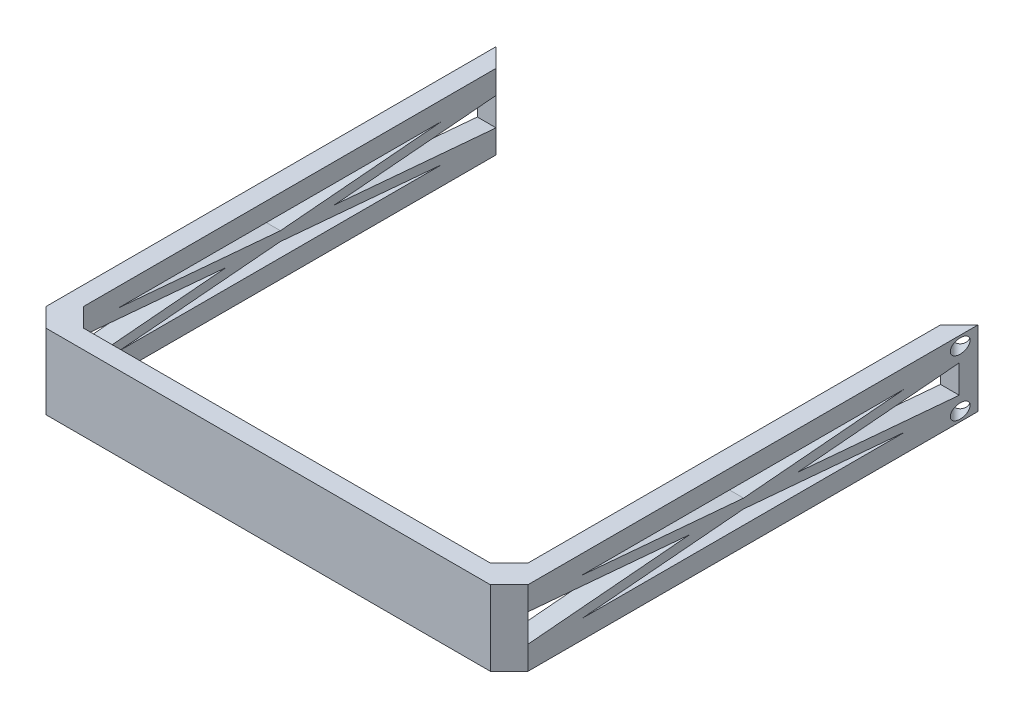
ISO-10303-21;
HEADER;
FILE_DESCRIPTION(('STEP AP214'),'2;1');
FILE_NAME('part.step','',(''),(''),'','','');
FILE_SCHEMA(('AUTOMOTIVE_DESIGN { 1 0 10303 214 1 1 1 1 }'));
ENDSEC;
DATA;
#1=APPLICATION_CONTEXT('core data for automotive mechanical design processes');
#2=APPLICATION_PROTOCOL_DEFINITION('international standard','automotive_design',2000,#1);
#3=PRODUCT_CONTEXT('',#1,'mechanical');
#4=PRODUCT('Part','Part','',(#3));
#5=PRODUCT_RELATED_PRODUCT_CATEGORY('part','',(#4));
#6=PRODUCT_DEFINITION_FORMATION('','',#4);
#7=PRODUCT_DEFINITION_CONTEXT('part definition',#1,'design');
#8=PRODUCT_DEFINITION('design','',#6,#7);
#9=PRODUCT_DEFINITION_SHAPE('','',#8);
#10=(LENGTH_UNIT() NAMED_UNIT(*) SI_UNIT(.MILLI.,.METRE.));
#11=(NAMED_UNIT(*) PLANE_ANGLE_UNIT() SI_UNIT($,.RADIAN.));
#12=(NAMED_UNIT(*) SI_UNIT($,.STERADIAN.) SOLID_ANGLE_UNIT());
#13=UNCERTAINTY_MEASURE_WITH_UNIT(LENGTH_MEASURE(1.E-05),#10,'distance_accuracy_value','');
#14=(GEOMETRIC_REPRESENTATION_CONTEXT(3) GLOBAL_UNCERTAINTY_ASSIGNED_CONTEXT((#13)) GLOBAL_UNIT_ASSIGNED_CONTEXT((#10,
#11,#12)) REPRESENTATION_CONTEXT('',''));
#15=CARTESIAN_POINT('',(0.,0.,0.));
#16=DIRECTION('',(0.,0.,1.));
#17=DIRECTION('',(1.,0.,0.));
#18=AXIS2_PLACEMENT_3D('',#15,#16,#17);
#19=CARTESIAN_POINT('',(-12.0621283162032,9.0406656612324,100.));
#20=DIRECTION('',(-1.,0.,0.));
#21=DIRECTION('',(0.,0.,1.));
#22=AXIS2_PLACEMENT_3D('',#19,#20,#21);
#23=PLANE('',#22);
#24=DIRECTION('',(0.,0.,-1.));
#25=VECTOR('',#24,1.);
#26=CARTESIAN_POINT('',(-12.0621283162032,9.0406656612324,100.));
#27=LINE('',#26,#25);
#28=CARTESIAN_POINT('',(-12.0621283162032,9.0406656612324,92.));
#29=VERTEX_POINT('',#28);
#30=CARTESIAN_POINT('',(-12.0621283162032,9.0406656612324,4.));
#31=VERTEX_POINT('',#30);
#32=EDGE_CURVE('E633',#29,#31,#27,.T.);
#33=ORIENTED_EDGE('',*,*,#32,.F.);
#34=DIRECTION('',(0.,-1.,0.));
#35=VECTOR('',#34,1.);
#36=CARTESIAN_POINT('',(-12.0621283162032,4.03689206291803,92.));
#37=LINE('',#36,#35);
#38=CARTESIAN_POINT('',(-12.0621283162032,3.68906597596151,92.));
#39=VERTEX_POINT('',#38);
#40=EDGE_CURVE('E658',#29,#39,#37,.T.);
#41=ORIENTED_EDGE('',*,*,#40,.T.);
#42=DIRECTION('',(0.,-0.086629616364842,-0.996240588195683));
#43=VECTOR('',#42,1.);
#44=CARTESIAN_POINT('',(-12.0621283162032,4.4196595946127,100.401826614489));
#45=LINE('',#44,#43);
#46=CARTESIAN_POINT('',(-12.0621283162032,1.0406656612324,61.5433963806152));
#47=VERTEX_POINT('',#46);
#48=EDGE_CURVE('E593',#39,#47,#45,.T.);
#49=ORIENTED_EDGE('',*,*,#48,.T.);
#50=DIRECTION('',(0.,-0.086629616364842,0.996240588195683));
#51=VECTOR('',#50,1.);
#52=CARTESIAN_POINT('',(-12.0621283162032,-2.21825322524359,99.0209635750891));
#53=LINE('',#52,#51);
#54=CARTESIAN_POINT('',(-12.0621283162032,-1.60773465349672,92.));
#55=VERTEX_POINT('',#54);
#56=EDGE_CURVE('E586',#47,#55,#53,.T.);
#57=ORIENTED_EDGE('',*,*,#56,.T.);
#58=DIRECTION('',(0.,-1.,0.));
#59=VECTOR('',#58,1.);
#60=CARTESIAN_POINT('',(-12.0621283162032,-6.95933433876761,92.));
#61=LINE('',#60,#59);
#62=CARTESIAN_POINT('',(-12.0621283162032,-6.95933433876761,92.));
#63=VERTEX_POINT('',#62);
#64=EDGE_CURVE('E656',#55,#63,#61,.T.);
#65=ORIENTED_EDGE('',*,*,#64,.T.);
#66=DIRECTION('',(0.,0.,-1.));
#67=VECTOR('',#66,1.);
#68=CARTESIAN_POINT('',(-12.0621283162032,-6.95933433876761,100.));
#69=LINE('',#68,#67);
#70=CARTESIAN_POINT('',(-12.0621283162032,-6.95933433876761,4.));
#71=VERTEX_POINT('',#70);
#72=EDGE_CURVE('E635',#63,#71,#69,.T.);
#73=ORIENTED_EDGE('',*,*,#72,.T.);
#74=DIRECTION('',(0.,1.,0.));
#75=VECTOR('',#74,1.);
#76=CARTESIAN_POINT('',(-12.0621283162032,9.0406656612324,4.));
#77=LINE('',#76,#75);
#78=CARTESIAN_POINT('',(-12.0621283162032,-1.95556074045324,4.));
#79=VERTEX_POINT('',#78);
#80=EDGE_CURVE('E640',#71,#79,#77,.T.);
#81=ORIENTED_EDGE('',*,*,#80,.T.);
#82=DIRECTION('',(0.,-0.086629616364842,-0.996240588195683));
#83=VECTOR('',#82,1.);
#84=CARTESIAN_POINT('',(-12.0621283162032,6.41214077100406,100.228567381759));
#85=LINE('',#84,#83);
#86=CARTESIAN_POINT('',(-12.0621283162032,1.0406656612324,38.4566036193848));
#87=VERTEX_POINT('',#86);
#88=EDGE_CURVE('E604',#87,#79,#85,.T.);
#89=ORIENTED_EDGE('',*,*,#88,.F.);
#90=DIRECTION('',(0.,-0.086629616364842,0.996240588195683));
#91=VECTOR('',#90,1.);
#92=CARTESIAN_POINT('',(-12.0621283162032,-4.21073440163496,98.8477043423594));
#93=LINE('',#92,#91);
#94=CARTESIAN_POINT('',(-12.0621283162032,4.03689206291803,4.));
#95=VERTEX_POINT('',#94);
#96=EDGE_CURVE('E607',#95,#87,#93,.T.);
#97=ORIENTED_EDGE('',*,*,#96,.F.);
#98=EDGE_CURVE('E639',#95,#31,#77,.T.);
#99=ORIENTED_EDGE('',*,*,#98,.T.);
#100=EDGE_LOOP('',(#33,#41,#49,#57,#65,#73,#81,#89,#97,#99));
#101=FACE_BOUND('',#100,.T.);
#102=DIRECTION('',(0.,-0.086629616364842,-0.996240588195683));
#103=VECTOR('',#102,1.);
#104=CARTESIAN_POINT('',(-12.0621283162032,6.41214077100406,100.228567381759));
#105=LINE('',#104,#103);
#106=CARTESIAN_POINT('',(-12.0621283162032,5.04066566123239,84.4566036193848));
#107=VERTEX_POINT('',#106);
#108=CARTESIAN_POINT('',(-12.0621283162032,2.04443925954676,50.));
#109=VERTEX_POINT('',#108);
#110=EDGE_CURVE('E598',#107,#109,#105,.T.);
#111=ORIENTED_EDGE('',*,*,#110,.F.);
#112=DIRECTION('',(0.,0.,-1.));
#113=VECTOR('',#112,1.);
#114=CARTESIAN_POINT('',(-12.0621283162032,5.0406656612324,100.));
#115=LINE('',#114,#113);
#116=CARTESIAN_POINT('',(-12.0621283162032,5.0406656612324,15.5433963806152));
#117=VERTEX_POINT('',#116);
#118=EDGE_CURVE('E601',#107,#117,#115,.T.);
#119=ORIENTED_EDGE('',*,*,#118,.T.);
#120=DIRECTION('',(0.,-0.086629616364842,0.996240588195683));
#121=VECTOR('',#120,1.);
#122=CARTESIAN_POINT('',(-12.0621283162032,-2.21825322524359,99.0209635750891));
#123=LINE('',#122,#121);
#124=EDGE_CURVE('E595',#117,#109,#123,.T.);
#125=ORIENTED_EDGE('',*,*,#124,.T.);
#126=EDGE_LOOP('',(#111,#119,#125));
#127=FACE_BOUND('',#126,.T.);
#128=DIRECTION('',(0.,-0.086629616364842,0.996240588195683));
#129=VECTOR('',#128,1.);
#130=CARTESIAN_POINT('',(-12.0621283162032,-4.21073440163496,98.8477043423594));
#131=LINE('',#130,#129);
#132=CARTESIAN_POINT('',(-12.0621283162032,0.0368920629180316,50.));
#133=VERTEX_POINT('',#132);
#134=CARTESIAN_POINT('',(-12.0621283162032,-2.9593343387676,84.4566036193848));
#135=VERTEX_POINT('',#134);
#136=EDGE_CURVE('E615',#133,#135,#131,.T.);
#137=ORIENTED_EDGE('',*,*,#136,.F.);
#138=DIRECTION('',(0.,-0.086629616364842,-0.996240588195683));
#139=VECTOR('',#138,1.);
#140=CARTESIAN_POINT('',(-12.0621283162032,4.4196595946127,100.401826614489));
#141=LINE('',#140,#139);
#142=CARTESIAN_POINT('',(-12.0621283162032,-2.9593343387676,15.5433963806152));
#143=VERTEX_POINT('',#142);
#144=EDGE_CURVE('E609',#133,#143,#141,.T.);
#145=ORIENTED_EDGE('',*,*,#144,.T.);
#146=DIRECTION('',(0.,0.,1.));
#147=VECTOR('',#146,1.);
#148=CARTESIAN_POINT('',(-12.0621283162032,-2.9593343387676,100.));
#149=LINE('',#148,#147);
#150=EDGE_CURVE('E612',#143,#135,#149,.T.);
#151=ORIENTED_EDGE('',*,*,#150,.T.);
#152=EDGE_LOOP('',(#137,#145,#151));
#153=FACE_BOUND('',#152,.T.);
#154=ADVANCED_FACE('F107',(#101,#127,#153),#23,.F.);
#155=CARTESIAN_POINT('',(-16.0621283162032,9.0406656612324,100.));
#156=DIRECTION('',(1.,0.,0.));
#157=DIRECTION('',(0.,1.,0.));
#158=AXIS2_PLACEMENT_3D('',#155,#156,#157);
#159=PLANE('',#158);
#160=CARTESIAN_POINT('',(-16.0621283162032,7.04066566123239,3.79592435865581));
#161=DIRECTION('',(1.,0.,0.));
#162=DIRECTION('',(0.,0.,-1.));
#163=AXIS2_PLACEMENT_3D('',#160,#161,#162);
#164=ELLIPSE('',#163,2.12132034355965,1.5);
#165=CARTESIAN_POINT('',(-16.0621283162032,7.04066566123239,1.67460401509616));
#166=VERTEX_POINT('',#165);
#167=EDGE_CURVE('E524',#166,#166,#164,.T.);
#168=ORIENTED_EDGE('',*,*,#167,.T.);
#169=EDGE_LOOP('',(#168));
#170=FACE_BOUND('',#169,.T.);
#171=CARTESIAN_POINT('',(-16.0621283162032,-4.95933433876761,3.79592435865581));
#172=DIRECTION('',(1.,0.,0.));
#173=DIRECTION('',(0.,0.,-1.));
#174=AXIS2_PLACEMENT_3D('',#171,#172,#173);
#175=ELLIPSE('',#174,2.12132034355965,1.5);
#176=CARTESIAN_POINT('',(-16.0621283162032,-4.95933433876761,1.67460401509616));
#177=VERTEX_POINT('',#176);
#178=EDGE_CURVE('E519',#177,#177,#175,.T.);
#179=ORIENTED_EDGE('',*,*,#178,.T.);
#180=EDGE_LOOP('',(#179));
#181=FACE_BOUND('',#180,.T.);
#182=DIRECTION('',(0.,-0.086629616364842,0.996240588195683));
#183=VECTOR('',#182,1.);
#184=CARTESIAN_POINT('',(-16.0621283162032,4.35181219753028,0.378418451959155));
#185=LINE('',#184,#183);
#186=CARTESIAN_POINT('',(-16.0621283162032,4.03689206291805,4.));
#187=VERTEX_POINT('',#186);
#188=CARTESIAN_POINT('',(-16.0621283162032,1.0406656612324,38.4566036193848));
#189=VERTEX_POINT('',#188);
#190=EDGE_CURVE('E527',#187,#189,#185,.T.);
#191=ORIENTED_EDGE('',*,*,#190,.T.);
#192=DIRECTION('',(0.,-0.086629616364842,-0.996240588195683));
#193=VECTOR('',#192,1.);
#194=CARTESIAN_POINT('',(-16.0621283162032,-2.28610062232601,0.198791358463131));
#195=LINE('',#194,#193);
#196=CARTESIAN_POINT('',(-16.0621283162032,-1.95556074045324,4.));
#197=VERTEX_POINT('',#196);
#198=EDGE_CURVE('E533',#189,#197,#195,.T.);
#199=ORIENTED_EDGE('',*,*,#198,.T.);
#200=DIRECTION('',(0.,-1.,0.));
#201=VECTOR('',#200,1.);
#202=CARTESIAN_POINT('',(-16.0621283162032,0.,4.));
#203=LINE('',#202,#201);
#204=EDGE_CURVE('E530',#187,#197,#203,.T.);
#205=ORIENTED_EDGE('',*,*,#204,.F.);
#206=EDGE_LOOP('',(#191,#199,#205));
#207=FACE_BOUND('',#206,.T.);
#208=DIRECTION('',(0.,-0.086629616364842,0.996240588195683));
#209=VECTOR('',#208,1.);
#210=CARTESIAN_POINT('',(-16.0621283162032,6.34429337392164,0.551677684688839));
#211=LINE('',#210,#209);
#212=CARTESIAN_POINT('',(-16.0621283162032,5.04066566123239,15.5433963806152));
#213=VERTEX_POINT('',#212);
#214=CARTESIAN_POINT('',(-16.0621283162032,2.04443925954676,50.));
#215=VERTEX_POINT('',#214);
#216=EDGE_CURVE('E577',#213,#215,#211,.T.);
#217=ORIENTED_EDGE('',*,*,#216,.F.);
#218=DIRECTION('',(0.,0.,-1.));
#219=VECTOR('',#218,1.);
#220=CARTESIAN_POINT('',(-16.0621283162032,5.04066566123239,0.));
#221=LINE('',#220,#219);
#222=CARTESIAN_POINT('',(-16.0621283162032,5.04066566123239,84.4566036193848));
#223=VERTEX_POINT('',#222);
#224=EDGE_CURVE('E570',#223,#213,#221,.T.);
#225=ORIENTED_EDGE('',*,*,#224,.F.);
#226=DIRECTION('',(0.,-0.086629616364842,-0.996240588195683));
#227=VECTOR('',#226,1.);
#228=CARTESIAN_POINT('',(-16.0621283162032,-2.28610062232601,0.198791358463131));
#229=LINE('',#228,#227);
#230=EDGE_CURVE('E580',#223,#215,#229,.T.);
#231=ORIENTED_EDGE('',*,*,#230,.T.);
#232=EDGE_LOOP('',(#217,#225,#231));
#233=FACE_BOUND('',#232,.T.);
#234=DIRECTION('',(0.,0.,-1.));
#235=VECTOR('',#234,1.);
#236=CARTESIAN_POINT('',(-16.0621283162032,-6.95933433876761,100.));
#237=LINE('',#236,#235);
#238=CARTESIAN_POINT('',(-16.0621283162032,-6.95933433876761,96.));
#239=VERTEX_POINT('',#238);
#240=CARTESIAN_POINT('',(-16.0621283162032,-6.95933433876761,0.));
#241=VERTEX_POINT('',#240);
#242=EDGE_CURVE('E637',#239,#241,#237,.T.);
#243=ORIENTED_EDGE('',*,*,#242,.F.);
#244=DIRECTION('',(0.,1.,0.));
#245=VECTOR('',#244,1.);
#246=CARTESIAN_POINT('',(-16.0621283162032,9.04066566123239,96.));
#247=LINE('',#246,#245);
#248=CARTESIAN_POINT('',(-16.0621283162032,-1.95556074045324,96.));
#249=VERTEX_POINT('',#248);
#250=EDGE_CURVE('E665',#239,#249,#247,.T.);
#251=ORIENTED_EDGE('',*,*,#250,.T.);
#252=DIRECTION('',(0.,-0.086629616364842,0.996240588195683));
#253=VECTOR('',#252,1.);
#254=CARTESIAN_POINT('',(-16.0621283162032,6.34429337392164,0.551677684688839));
#255=LINE('',#254,#253);
#256=CARTESIAN_POINT('',(-16.0621283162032,1.04066566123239,61.5433963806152));
#257=VERTEX_POINT('',#256);
#258=EDGE_CURVE('E561',#257,#249,#255,.T.);
#259=ORIENTED_EDGE('',*,*,#258,.F.);
#260=DIRECTION('',(0.,-0.086629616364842,-0.996240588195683));
#261=VECTOR('',#260,1.);
#262=CARTESIAN_POINT('',(-16.0621283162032,-4.27858179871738,0.372050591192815));
#263=LINE('',#262,#261);
#264=CARTESIAN_POINT('',(-16.0621283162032,4.03689206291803,96.));
#265=VERTEX_POINT('',#264);
#266=EDGE_CURVE('E555',#265,#257,#263,.T.);
#267=ORIENTED_EDGE('',*,*,#266,.F.);
#268=DIRECTION('',(0.,1.,0.));
#269=VECTOR('',#268,1.);
#270=CARTESIAN_POINT('',(-16.0621283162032,9.04066566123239,96.));
#271=LINE('',#270,#269);
#272=CARTESIAN_POINT('',(-16.0621283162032,9.0406656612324,96.));
#273=VERTEX_POINT('',#272);
#274=EDGE_CURVE('E123',#265,#273,#271,.T.);
#275=ORIENTED_EDGE('',*,*,#274,.T.);
#276=DIRECTION('',(0.,0.,-1.));
#277=VECTOR('',#276,1.);
#278=CARTESIAN_POINT('',(-16.0621283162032,9.0406656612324,100.));
#279=LINE('',#278,#277);
#280=CARTESIAN_POINT('',(-16.0621283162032,9.0406656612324,0.));
#281=VERTEX_POINT('',#280);
#282=EDGE_CURVE('E629',#273,#281,#279,.T.);
#283=ORIENTED_EDGE('',*,*,#282,.T.);
#284=DIRECTION('',(0.,-1.,0.));
#285=VECTOR('',#284,1.);
#286=CARTESIAN_POINT('',(-16.0621283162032,9.0406656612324,0.));
#287=LINE('',#286,#285);
#288=EDGE_CURVE('E623',#281,#241,#287,.T.);
#289=ORIENTED_EDGE('',*,*,#288,.T.);
#290=EDGE_LOOP('',(#243,#251,#259,#267,#275,#283,#289));
#291=FACE_BOUND('',#290,.T.);
#292=DIRECTION('',(0.,-0.086629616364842,0.996240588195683));
#293=VECTOR('',#292,1.);
#294=CARTESIAN_POINT('',(-16.0621283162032,4.35181219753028,0.378418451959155));
#295=LINE('',#294,#293);
#296=CARTESIAN_POINT('',(-16.0621283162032,0.0368920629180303,50.));
#297=VERTEX_POINT('',#296);
#298=CARTESIAN_POINT('',(-16.0621283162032,-2.95933433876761,84.4566036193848));
#299=VERTEX_POINT('',#298);
#300=EDGE_CURVE('E539',#297,#299,#295,.T.);
#301=ORIENTED_EDGE('',*,*,#300,.T.);
#302=DIRECTION('',(0.,0.,1.));
#303=VECTOR('',#302,1.);
#304=CARTESIAN_POINT('',(-16.0621283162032,-2.95933433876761,0.));
#305=LINE('',#304,#303);
#306=CARTESIAN_POINT('',(-16.0621283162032,-2.95933433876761,15.5433963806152));
#307=VERTEX_POINT('',#306);
#308=EDGE_CURVE('E549',#307,#299,#305,.T.);
#309=ORIENTED_EDGE('',*,*,#308,.F.);
#310=DIRECTION('',(0.,-0.086629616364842,-0.996240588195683));
#311=VECTOR('',#310,1.);
#312=CARTESIAN_POINT('',(-16.0621283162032,-4.27858179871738,0.372050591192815));
#313=LINE('',#312,#311);
#314=EDGE_CURVE('E546',#297,#307,#313,.T.);
#315=ORIENTED_EDGE('',*,*,#314,.F.);
#316=EDGE_LOOP('',(#301,#309,#315));
#317=FACE_BOUND('',#316,.T.);
#318=ADVANCED_FACE('F724',(#170,#181,#207,#233,#291,#317),#159,.F.);
#319=CARTESIAN_POINT('',(-16.0621283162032,-6.95933433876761,100.));
#320=DIRECTION('',(0.,1.,0.));
#321=DIRECTION('',(0.,0.,1.));
#322=AXIS2_PLACEMENT_3D('',#319,#320,#321);
#323=PLANE('',#322);
#324=DIRECTION('',(1.,0.,0.));
#325=VECTOR('',#324,1.);
#326=CARTESIAN_POINT('',(-16.0621283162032,-6.95933433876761,100.));
#327=LINE('',#326,#325);
#328=CARTESIAN_POINT('',(-12.0621283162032,-6.95933433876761,100.));
#329=VERTEX_POINT('',#328);
#330=CARTESIAN_POINT('',(82.7278716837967,-6.95933433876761,100.));
#331=VERTEX_POINT('',#330);
#332=EDGE_CURVE('E624',#329,#331,#327,.T.);
#333=ORIENTED_EDGE('',*,*,#332,.F.);
#334=DIRECTION('',(-0.707106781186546,0.,-0.707106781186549));
#335=VECTOR('',#334,1.);
#336=CARTESIAN_POINT('',(-12.0621283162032,-6.95933433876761,100.));
#337=LINE('',#336,#335);
#338=EDGE_CURVE('E131',#329,#239,#337,.T.);
#339=ORIENTED_EDGE('',*,*,#338,.T.);
#340=ORIENTED_EDGE('',*,*,#242,.T.);
#341=DIRECTION('',(-0.707106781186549,0.,-0.707106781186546));
#342=VECTOR('',#341,1.);
#343=CARTESIAN_POINT('',(-12.0621283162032,-6.95933433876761,4.));
#344=LINE('',#343,#342);
#345=EDGE_CURVE('E647',#241,#71,#344,.F.);
#346=ORIENTED_EDGE('',*,*,#345,.T.);
#347=ORIENTED_EDGE('',*,*,#72,.F.);
#348=DIRECTION('',(-0.707106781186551,0.,-0.707106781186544));
#349=VECTOR('',#348,1.);
#350=CARTESIAN_POINT('',(-10.0621283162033,-6.95933433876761,94.));
#351=LINE('',#350,#349);
#352=CARTESIAN_POINT('',(-8.06212831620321,-6.95933433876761,96.));
#353=VERTEX_POINT('',#352);
#354=EDGE_CURVE('E12',#63,#353,#351,.F.);
#355=ORIENTED_EDGE('',*,*,#354,.T.);
#356=DIRECTION('',(-1.,0.,0.));
#357=VECTOR('',#356,1.);
#358=CARTESIAN_POINT('',(35.3328716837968,-6.95933433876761,96.));
#359=LINE('',#358,#357);
#360=CARTESIAN_POINT('',(78.7278716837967,-6.95933433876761,96.));
#361=VERTEX_POINT('',#360);
#362=EDGE_CURVE('E620',#361,#353,#359,.T.);
#363=ORIENTED_EDGE('',*,*,#362,.F.);
#364=DIRECTION('',(0.707106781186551,0.,-0.707106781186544));
#365=VECTOR('',#364,1.);
#366=CARTESIAN_POINT('',(80.7278716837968,-6.95933433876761,94.));
#367=LINE('',#366,#365);
#368=CARTESIAN_POINT('',(82.7278716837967,-6.95933433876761,92.));
#369=VERTEX_POINT('',#368);
#370=EDGE_CURVE('E512',#369,#361,#367,.F.);
#371=ORIENTED_EDGE('',*,*,#370,.F.);
#372=DIRECTION('',(0.,0.,-1.));
#373=VECTOR('',#372,1.);
#374=CARTESIAN_POINT('',(82.7278716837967,-6.95933433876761,100.));
#375=LINE('',#374,#373);
#376=CARTESIAN_POINT('',(82.7278716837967,-6.95933433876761,4.));
#377=VERTEX_POINT('',#376);
#378=EDGE_CURVE('E467',#369,#377,#375,.T.);
#379=ORIENTED_EDGE('',*,*,#378,.T.);
#380=DIRECTION('',(0.707106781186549,0.,-0.707106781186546));
#381=VECTOR('',#380,1.);
#382=CARTESIAN_POINT('',(82.7278716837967,-6.95933433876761,4.));
#383=LINE('',#382,#381);
#384=CARTESIAN_POINT('',(86.7278716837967,-6.95933433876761,0.));
#385=VERTEX_POINT('',#384);
#386=EDGE_CURVE('E478',#385,#377,#383,.F.);
#387=ORIENTED_EDGE('',*,*,#386,.F.);
#388=DIRECTION('',(0.,0.,-1.));
#389=VECTOR('',#388,1.);
#390=CARTESIAN_POINT('',(86.7278716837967,-6.95933433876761,100.));
#391=LINE('',#390,#389);
#392=CARTESIAN_POINT('',(86.7278716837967,-6.95933433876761,96.));
#393=VERTEX_POINT('',#392);
#394=EDGE_CURVE('E470',#393,#385,#391,.T.);
#395=ORIENTED_EDGE('',*,*,#394,.F.);
#396=DIRECTION('',(0.707106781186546,0.,-0.707106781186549));
#397=VECTOR('',#396,1.);
#398=CARTESIAN_POINT('',(82.7278716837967,-6.95933433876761,100.));
#399=LINE('',#398,#397);
#400=EDGE_CURVE('E495',#331,#393,#399,.T.);
#401=ORIENTED_EDGE('',*,*,#400,.F.);
#402=EDGE_LOOP('',(#333,#339,#340,#346,#347,#355,#363,#371,#379,#387,#395,#401));
#403=FACE_BOUND('',#402,.T.);
#404=ADVANCED_FACE('F688',(#403),#323,.F.);
#405=CARTESIAN_POINT('',(-16.0621283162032,9.0406656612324,100.));
#406=DIRECTION('',(0.,-1.,0.));
#407=DIRECTION('',(0.,0.,-1.));
#408=AXIS2_PLACEMENT_3D('',#405,#406,#407);
#409=PLANE('',#408);
#410=ORIENTED_EDGE('',*,*,#282,.F.);
#411=DIRECTION('',(0.707106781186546,0.,0.707106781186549));
#412=VECTOR('',#411,1.);
#413=CARTESIAN_POINT('',(-12.0621283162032,9.0406656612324,100.));
#414=LINE('',#413,#412);
#415=CARTESIAN_POINT('',(-12.0621283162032,9.0406656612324,100.));
#416=VERTEX_POINT('',#415);
#417=EDGE_CURVE('E667',#273,#416,#414,.T.);
#418=ORIENTED_EDGE('',*,*,#417,.T.);
#419=DIRECTION('',(-1.,0.,0.));
#420=VECTOR('',#419,1.);
#421=CARTESIAN_POINT('',(-16.0621283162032,9.0406656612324,100.));
#422=LINE('',#421,#420);
#423=CARTESIAN_POINT('',(82.7278716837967,9.0406656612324,100.));
#424=VERTEX_POINT('',#423);
#425=EDGE_CURVE('E626',#424,#416,#422,.T.);
#426=ORIENTED_EDGE('',*,*,#425,.F.);
#427=DIRECTION('',(-0.707106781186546,0.,0.707106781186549));
#428=VECTOR('',#427,1.);
#429=CARTESIAN_POINT('',(82.7278716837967,9.0406656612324,100.));
#430=LINE('',#429,#428);
#431=CARTESIAN_POINT('',(86.7278716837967,9.0406656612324,96.));
#432=VERTEX_POINT('',#431);
#433=EDGE_CURVE('E503',#432,#424,#430,.T.);
#434=ORIENTED_EDGE('',*,*,#433,.F.);
#435=DIRECTION('',(0.,0.,-1.));
#436=VECTOR('',#435,1.);
#437=CARTESIAN_POINT('',(86.7278716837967,9.0406656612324,100.));
#438=LINE('',#437,#436);
#439=CARTESIAN_POINT('',(86.7278716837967,9.0406656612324,0.));
#440=VERTEX_POINT('',#439);
#441=EDGE_CURVE('E461',#432,#440,#438,.T.);
#442=ORIENTED_EDGE('',*,*,#441,.T.);
#443=DIRECTION('',(-0.707106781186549,0.,0.707106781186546));
#444=VECTOR('',#443,1.);
#445=CARTESIAN_POINT('',(82.7278716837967,9.0406656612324,4.));
#446=LINE('',#445,#444);
#447=CARTESIAN_POINT('',(82.7278716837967,9.0406656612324,4.));
#448=VERTEX_POINT('',#447);
#449=EDGE_CURVE('E476',#448,#440,#446,.F.);
#450=ORIENTED_EDGE('',*,*,#449,.F.);
#451=DIRECTION('',(0.,0.,-1.));
#452=VECTOR('',#451,1.);
#453=CARTESIAN_POINT('',(82.7278716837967,9.0406656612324,100.));
#454=LINE('',#453,#452);
#455=CARTESIAN_POINT('',(82.7278716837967,9.0406656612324,92.));
#456=VERTEX_POINT('',#455);
#457=EDGE_CURVE('E464',#456,#448,#454,.T.);
#458=ORIENTED_EDGE('',*,*,#457,.F.);
#459=DIRECTION('',(-0.707106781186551,0.,0.707106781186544));
#460=VECTOR('',#459,1.);
#461=CARTESIAN_POINT('',(80.7278716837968,9.0406656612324,94.));
#462=LINE('',#461,#460);
#463=CARTESIAN_POINT('',(78.7278716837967,9.0406656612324,96.));
#464=VERTEX_POINT('',#463);
#465=EDGE_CURVE('E506',#464,#456,#462,.F.);
#466=ORIENTED_EDGE('',*,*,#465,.F.);
#467=DIRECTION('',(-1.,0.,0.));
#468=VECTOR('',#467,1.);
#469=CARTESIAN_POINT('',(35.3328716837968,9.0406656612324,96.));
#470=LINE('',#469,#468);
#471=CARTESIAN_POINT('',(-8.06212831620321,9.0406656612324,96.));
#472=VERTEX_POINT('',#471);
#473=EDGE_CURVE('E617',#464,#472,#470,.T.);
#474=ORIENTED_EDGE('',*,*,#473,.T.);
#475=DIRECTION('',(0.707106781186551,0.,0.707106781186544));
#476=VECTOR('',#475,1.);
#477=CARTESIAN_POINT('',(-10.0621283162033,9.0406656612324,94.));
#478=LINE('',#477,#476);
#479=EDGE_CURVE('E669',#472,#29,#478,.F.);
#480=ORIENTED_EDGE('',*,*,#479,.T.);
#481=ORIENTED_EDGE('',*,*,#32,.T.);
#482=DIRECTION('',(0.707106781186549,0.,0.707106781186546));
#483=VECTOR('',#482,1.);
#484=CARTESIAN_POINT('',(-12.0621283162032,9.0406656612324,4.));
#485=LINE('',#484,#483);
#486=EDGE_CURVE('E643',#31,#281,#485,.F.);
#487=ORIENTED_EDGE('',*,*,#486,.T.);
#488=EDGE_LOOP('',(#410,#418,#426,#434,#442,#450,#458,#466,#474,#480,#481,#487));
#489=FACE_BOUND('',#488,.T.);
#490=ADVANCED_FACE('F734',(#489),#409,.F.);
#491=CARTESIAN_POINT('',(0.,0.,100.));
#492=DIRECTION('',(0.,0.,1.));
#493=DIRECTION('',(1.,0.,0.));
#494=AXIS2_PLACEMENT_3D('',#491,#492,#493);
#495=PLANE('',#494);
#496=ORIENTED_EDGE('',*,*,#425,.T.);
#497=DIRECTION('',(0.,-1.,0.));
#498=VECTOR('',#497,1.);
#499=CARTESIAN_POINT('',(-12.0621283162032,-6.9593343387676,100.));
#500=LINE('',#499,#498);
#501=EDGE_CURVE('E660',#416,#329,#500,.T.);
#502=ORIENTED_EDGE('',*,*,#501,.T.);
#503=ORIENTED_EDGE('',*,*,#332,.T.);
#504=DIRECTION('',(0.,-1.,0.));
#505=VECTOR('',#504,1.);
#506=CARTESIAN_POINT('',(82.7278716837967,-6.9593343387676,100.));
#507=LINE('',#506,#505);
#508=EDGE_CURVE('E492',#424,#331,#507,.T.);
#509=ORIENTED_EDGE('',*,*,#508,.F.);
#510=EDGE_LOOP('',(#496,#502,#503,#509));
#511=FACE_BOUND('',#510,.T.);
#512=ADVANCED_FACE('F717',(#511),#495,.T.);
#513=CARTESIAN_POINT('',(35.3328716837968,9.0406656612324,96.));
#514=DIRECTION('',(0.,0.,1.));
#515=DIRECTION('',(1.,0.,0.));
#516=AXIS2_PLACEMENT_3D('',#513,#514,#515);
#517=PLANE('',#516);
#518=DIRECTION('',(-1.,0.,0.));
#519=VECTOR('',#518,1.);
#520=CARTESIAN_POINT('',(53.9378716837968,4.03689206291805,96.));
#521=LINE('',#520,#519);
#522=CARTESIAN_POINT('',(-8.06212831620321,4.03689206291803,96.));
#523=VERTEX_POINT('',#522);
#524=EDGE_CURVE('E568',#523,#265,#521,.T.);
#525=ORIENTED_EDGE('',*,*,#524,.F.);
#526=DIRECTION('',(0.,1.,0.));
#527=VECTOR('',#526,1.);
#528=CARTESIAN_POINT('',(-8.06212831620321,9.0406656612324,96.));
#529=LINE('',#528,#527);
#530=EDGE_CURVE('E653',#523,#472,#529,.T.);
#531=ORIENTED_EDGE('',*,*,#530,.T.);
#532=ORIENTED_EDGE('',*,*,#473,.F.);
#533=DIRECTION('',(0.,1.,0.));
#534=VECTOR('',#533,1.);
#535=CARTESIAN_POINT('',(78.7278716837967,9.0406656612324,96.));
#536=LINE('',#535,#534);
#537=CARTESIAN_POINT('',(78.7278716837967,4.03689206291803,96.));
#538=VERTEX_POINT('',#537);
#539=EDGE_CURVE('E483',#538,#464,#536,.T.);
#540=ORIENTED_EDGE('',*,*,#539,.F.);
#541=DIRECTION('',(1.,0.,0.));
#542=VECTOR('',#541,1.);
#543=CARTESIAN_POINT('',(16.7278716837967,4.03689206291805,96.));
#544=LINE('',#543,#542);
#545=CARTESIAN_POINT('',(86.7278716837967,4.03689206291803,96.));
#546=VERTEX_POINT('',#545);
#547=EDGE_CURVE('E407',#538,#546,#544,.T.);
#548=ORIENTED_EDGE('',*,*,#547,.T.);
#549=DIRECTION('',(0.,1.,0.));
#550=VECTOR('',#549,1.);
#551=CARTESIAN_POINT('',(86.7278716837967,0.,96.));
#552=LINE('',#551,#550);
#553=CARTESIAN_POINT('',(86.7278716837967,-1.95556074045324,96.));
#554=VERTEX_POINT('',#553);
#555=EDGE_CURVE('E404',#554,#546,#552,.T.);
#556=ORIENTED_EDGE('',*,*,#555,.F.);
#557=DIRECTION('',(1.,0.,0.));
#558=VECTOR('',#557,1.);
#559=CARTESIAN_POINT('',(16.7278716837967,-1.95556074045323,96.));
#560=LINE('',#559,#558);
#561=CARTESIAN_POINT('',(78.7278716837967,-1.95556074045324,96.));
#562=VERTEX_POINT('',#561);
#563=EDGE_CURVE('E411',#562,#554,#560,.T.);
#564=ORIENTED_EDGE('',*,*,#563,.F.);
#565=DIRECTION('',(0.,1.,0.));
#566=VECTOR('',#565,1.);
#567=CARTESIAN_POINT('',(78.7278716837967,-1.95556074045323,96.));
#568=LINE('',#567,#566);
#569=EDGE_CURVE('E480',#361,#562,#568,.T.);
#570=ORIENTED_EDGE('',*,*,#569,.F.);
#571=ORIENTED_EDGE('',*,*,#362,.T.);
#572=DIRECTION('',(0.,1.,0.));
#573=VECTOR('',#572,1.);
#574=CARTESIAN_POINT('',(-8.06212831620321,-1.95556074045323,96.));
#575=LINE('',#574,#573);
#576=CARTESIAN_POINT('',(-8.06212831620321,-1.95556074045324,96.));
#577=VERTEX_POINT('',#576);
#578=EDGE_CURVE('E650',#353,#577,#575,.T.);
#579=ORIENTED_EDGE('',*,*,#578,.T.);
#580=DIRECTION('',(-1.,0.,0.));
#581=VECTOR('',#580,1.);
#582=CARTESIAN_POINT('',(53.9378716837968,-1.95556074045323,96.));
#583=LINE('',#582,#581);
#584=EDGE_CURVE('E571',#577,#249,#583,.T.);
#585=ORIENTED_EDGE('',*,*,#584,.T.);
#586=DIRECTION('',(0.,1.,0.));
#587=VECTOR('',#586,1.);
#588=CARTESIAN_POINT('',(-16.0621283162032,0.,96.));
#589=LINE('',#588,#587);
#590=EDGE_CURVE('E564',#249,#265,#589,.T.);
#591=ORIENTED_EDGE('',*,*,#590,.T.);
#592=EDGE_LOOP('',(#525,#531,#532,#540,#548,#556,#564,#570,#571,#579,#585,#591));
#593=FACE_BOUND('',#592,.T.);
#594=ADVANCED_FACE('F691',(#593),#517,.F.);
#595=CARTESIAN_POINT('',(-12.0621283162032,9.0406656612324,4.));
#596=DIRECTION('',(-0.707106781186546,0.,0.707106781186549));
#597=DIRECTION('',(0.,1.,0.));
#598=AXIS2_PLACEMENT_3D('',#595,#596,#597);
#599=PLANE('',#598);
#600=CARTESIAN_POINT('',(-14.1641661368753,7.04066566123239,1.8979621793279));
#601=DIRECTION('',(0.707106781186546,0.,-0.707106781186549));
#602=DIRECTION('',(-0.707106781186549,0.,-0.707106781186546));
#603=AXIS2_PLACEMENT_3D('',#600,#601,#602);
#604=CIRCLE('',#603,1.5);
#605=CARTESIAN_POINT('',(-15.2248263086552,7.04066566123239,0.837302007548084));
#606=VERTEX_POINT('',#605);
#607=EDGE_CURVE('E516',#606,#606,#604,.T.);
#608=ORIENTED_EDGE('',*,*,#607,.F.);
#609=EDGE_LOOP('',(#608));
#610=FACE_BOUND('',#609,.T.);
#611=CARTESIAN_POINT('',(-14.1641661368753,-4.95933433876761,1.8979621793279));
#612=DIRECTION('',(0.707106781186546,0.,-0.707106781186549));
#613=DIRECTION('',(-0.707106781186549,0.,-0.707106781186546));
#614=AXIS2_PLACEMENT_3D('',#611,#612,#613);
#615=CIRCLE('',#614,1.5);
#616=CARTESIAN_POINT('',(-15.2248263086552,-4.95933433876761,0.837302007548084));
#617=VERTEX_POINT('',#616);
#618=EDGE_CURVE('E515',#617,#617,#615,.T.);
#619=ORIENTED_EDGE('',*,*,#618,.F.);
#620=EDGE_LOOP('',(#619));
#621=FACE_BOUND('',#620,.T.);
#622=ORIENTED_EDGE('',*,*,#345,.F.);
#623=ORIENTED_EDGE('',*,*,#288,.F.);
#624=ORIENTED_EDGE('',*,*,#486,.F.);
#625=ORIENTED_EDGE('',*,*,#98,.F.);
#626=EDGE_CURVE('E644',#79,#95,#77,.T.);
#627=ORIENTED_EDGE('',*,*,#626,.F.);
#628=ORIENTED_EDGE('',*,*,#80,.F.);
#629=EDGE_LOOP('',(#622,#623,#624,#625,#627,#628));
#630=FACE_BOUND('',#629,.T.);
#631=ADVANCED_FACE('F753',(#610,#621,#630),#599,.F.);
#632=CARTESIAN_POINT('',(53.9378716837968,4.35181219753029,0.378418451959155));
#633=DIRECTION('',(0.,-0.996240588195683,-0.086629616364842));
#634=DIRECTION('',(0.,0.086629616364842,-0.996240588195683));
#635=AXIS2_PLACEMENT_3D('',#632,#633,#634);
#636=PLANE('',#635);
#637=ORIENTED_EDGE('',*,*,#96,.T.);
#638=DIRECTION('',(-1.,0.,0.));
#639=VECTOR('',#638,1.);
#640=CARTESIAN_POINT('',(53.9378716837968,1.04066566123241,38.4566036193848));
#641=LINE('',#640,#639);
#642=EDGE_CURVE('E537',#87,#189,#641,.T.);
#643=ORIENTED_EDGE('',*,*,#642,.T.);
#644=ORIENTED_EDGE('',*,*,#190,.F.);
#645=DIRECTION('',(-1.,0.,0.));
#646=VECTOR('',#645,1.);
#647=CARTESIAN_POINT('',(53.9378716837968,4.03689206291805,4.));
#648=LINE('',#647,#646);
#649=EDGE_CURVE('E536',#95,#187,#648,.T.);
#650=ORIENTED_EDGE('',*,*,#649,.F.);
#651=EDGE_LOOP('',(#637,#643,#644,#650));
#652=FACE_BOUND('',#651,.T.);
#653=ADVANCED_FACE('F764',(#652),#636,.T.);
#654=CARTESIAN_POINT('',(53.9378716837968,-2.286100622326,0.198791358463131));
#655=DIRECTION('',(0.,0.996240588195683,-0.086629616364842));
#656=DIRECTION('',(0.,0.086629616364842,0.996240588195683));
#657=AXIS2_PLACEMENT_3D('',#654,#655,#656);
#658=PLANE('',#657);
#659=ORIENTED_EDGE('',*,*,#88,.T.);
#660=DIRECTION('',(-1.,0.,0.));
#661=VECTOR('',#660,1.);
#662=CARTESIAN_POINT('',(53.9378716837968,-1.95556074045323,4.));
#663=LINE('',#662,#661);
#664=EDGE_CURVE('E540',#79,#197,#663,.T.);
#665=ORIENTED_EDGE('',*,*,#664,.T.);
#666=ORIENTED_EDGE('',*,*,#198,.F.);
#667=ORIENTED_EDGE('',*,*,#642,.F.);
#668=EDGE_LOOP('',(#659,#665,#666,#667));
#669=FACE_BOUND('',#668,.T.);
#670=ADVANCED_FACE('F761',(#669),#658,.T.);
#671=CARTESIAN_POINT('',(53.9378716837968,0.,4.));
#672=DIRECTION('',(0.,0.,-1.));
#673=DIRECTION('',(-1.,0.,0.));
#674=AXIS2_PLACEMENT_3D('',#671,#672,#673);
#675=PLANE('',#674);
#676=ORIENTED_EDGE('',*,*,#626,.T.);
#677=ORIENTED_EDGE('',*,*,#649,.T.);
#678=ORIENTED_EDGE('',*,*,#204,.T.);
#679=ORIENTED_EDGE('',*,*,#664,.F.);
#680=EDGE_LOOP('',(#676,#677,#678,#679));
#681=FACE_BOUND('',#680,.T.);
#682=ADVANCED_FACE('F768',(#681),#675,.F.);
#683=CARTESIAN_POINT('',(53.9378716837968,5.04066566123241,0.));
#684=DIRECTION('',(0.,1.,0.));
#685=DIRECTION('',(-1.,0.,0.));
#686=AXIS2_PLACEMENT_3D('',#683,#684,#685);
#687=PLANE('',#686);
#688=DIRECTION('',(-1.,0.,0.));
#689=VECTOR('',#688,1.);
#690=CARTESIAN_POINT('',(53.9378716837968,5.04066566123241,84.4566036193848));
#691=LINE('',#690,#689);
#692=EDGE_CURVE('E584',#107,#223,#691,.T.);
#693=ORIENTED_EDGE('',*,*,#692,.T.);
#694=ORIENTED_EDGE('',*,*,#224,.T.);
#695=DIRECTION('',(-1.,0.,0.));
#696=VECTOR('',#695,1.);
#697=CARTESIAN_POINT('',(53.9378716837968,5.04066566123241,15.5433963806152));
#698=LINE('',#697,#696);
#699=EDGE_CURVE('E583',#117,#213,#698,.T.);
#700=ORIENTED_EDGE('',*,*,#699,.F.);
#701=ORIENTED_EDGE('',*,*,#118,.F.);
#702=EDGE_LOOP('',(#693,#694,#700,#701));
#703=FACE_BOUND('',#702,.T.);
#704=ADVANCED_FACE('F781',(#703),#687,.F.);
#705=CARTESIAN_POINT('',(53.9378716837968,-2.286100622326,0.198791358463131));
#706=DIRECTION('',(0.,0.996240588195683,-0.086629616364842));
#707=DIRECTION('',(0.,0.086629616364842,0.996240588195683));
#708=AXIS2_PLACEMENT_3D('',#705,#706,#707);
#709=PLANE('',#708);
#710=ORIENTED_EDGE('',*,*,#110,.T.);
#711=DIRECTION('',(-1.,0.,0.));
#712=VECTOR('',#711,1.);
#713=CARTESIAN_POINT('',(53.9378716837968,2.04443925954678,50.));
#714=LINE('',#713,#712);
#715=EDGE_CURVE('E587',#109,#215,#714,.T.);
#716=ORIENTED_EDGE('',*,*,#715,.T.);
#717=ORIENTED_EDGE('',*,*,#230,.F.);
#718=ORIENTED_EDGE('',*,*,#692,.F.);
#719=EDGE_LOOP('',(#710,#716,#717,#718));
#720=FACE_BOUND('',#719,.T.);
#721=ADVANCED_FACE('F786',(#720),#709,.T.);
#722=CARTESIAN_POINT('',(53.9378716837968,6.34429337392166,0.551677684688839));
#723=DIRECTION('',(0.,-0.996240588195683,-0.086629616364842));
#724=DIRECTION('',(0.,0.086629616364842,-0.996240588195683));
#725=AXIS2_PLACEMENT_3D('',#722,#723,#724);
#726=PLANE('',#725);
#727=ORIENTED_EDGE('',*,*,#699,.T.);
#728=ORIENTED_EDGE('',*,*,#216,.T.);
#729=ORIENTED_EDGE('',*,*,#715,.F.);
#730=ORIENTED_EDGE('',*,*,#124,.F.);
#731=EDGE_LOOP('',(#727,#728,#729,#730));
#732=FACE_BOUND('',#731,.T.);
#733=ADVANCED_FACE('F778',(#732),#726,.F.);
#734=CARTESIAN_POINT('',(53.9378716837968,-4.27858179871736,0.372050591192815));
#735=DIRECTION('',(0.,0.996240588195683,-0.086629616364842));
#736=DIRECTION('',(0.,0.086629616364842,0.996240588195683));
#737=AXIS2_PLACEMENT_3D('',#734,#735,#736);
#738=PLANE('',#737);
#739=ORIENTED_EDGE('',*,*,#524,.T.);
#740=ORIENTED_EDGE('',*,*,#266,.T.);
#741=DIRECTION('',(-1.,0.,0.));
#742=VECTOR('',#741,1.);
#743=CARTESIAN_POINT('',(53.9378716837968,1.04066566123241,61.5433963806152));
#744=LINE('',#743,#742);
#745=EDGE_CURVE('E567',#47,#257,#744,.T.);
#746=ORIENTED_EDGE('',*,*,#745,.F.);
#747=ORIENTED_EDGE('',*,*,#48,.F.);
#748=DIRECTION('',(-0.705773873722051,-0.0613716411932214,-0.705773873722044));
#749=VECTOR('',#748,1.);
#750=CARTESIAN_POINT('',(-25.1729541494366,2.548994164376,78.8891741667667));
#751=LINE('',#750,#749);
#752=EDGE_CURVE('E671',#39,#523,#751,.F.);
#753=ORIENTED_EDGE('',*,*,#752,.T.);
#754=EDGE_LOOP('',(#739,#740,#746,#747,#753));
#755=FACE_BOUND('',#754,.T.);
#756=ADVANCED_FACE('F727',(#755),#738,.F.);
#757=CARTESIAN_POINT('',(53.9378716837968,6.34429337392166,0.551677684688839));
#758=DIRECTION('',(0.,-0.996240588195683,-0.086629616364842));
#759=DIRECTION('',(0.,0.086629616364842,-0.996240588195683));
#760=AXIS2_PLACEMENT_3D('',#757,#758,#759);
#761=PLANE('',#760);
#762=ORIENTED_EDGE('',*,*,#745,.T.);
#763=ORIENTED_EDGE('',*,*,#258,.T.);
#764=ORIENTED_EDGE('',*,*,#584,.F.);
#765=DIRECTION('',(0.705773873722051,-0.0613716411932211,0.705773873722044));
#766=VECTOR('',#765,1.);
#767=CARTESIAN_POINT('',(-25.0828023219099,-0.475502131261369,78.9793259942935));
#768=LINE('',#767,#766);
#769=EDGE_CURVE('E116',#577,#55,#768,.F.);
#770=ORIENTED_EDGE('',*,*,#769,.T.);
#771=ORIENTED_EDGE('',*,*,#56,.F.);
#772=EDGE_LOOP('',(#762,#763,#764,#770,#771));
#773=FACE_BOUND('',#772,.T.);
#774=ADVANCED_FACE('F676',(#773),#761,.F.);
#775=CARTESIAN_POINT('',(53.9378716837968,4.35181219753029,0.378418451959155));
#776=DIRECTION('',(0.,-0.996240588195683,-0.086629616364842));
#777=DIRECTION('',(0.,0.086629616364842,-0.996240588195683));
#778=AXIS2_PLACEMENT_3D('',#775,#776,#777);
#779=PLANE('',#778);
#780=ORIENTED_EDGE('',*,*,#136,.T.);
#781=DIRECTION('',(-1.,0.,0.));
#782=VECTOR('',#781,1.);
#783=CARTESIAN_POINT('',(53.9378716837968,-2.95933433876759,84.4566036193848));
#784=LINE('',#783,#782);
#785=EDGE_CURVE('E553',#135,#299,#784,.T.);
#786=ORIENTED_EDGE('',*,*,#785,.T.);
#787=ORIENTED_EDGE('',*,*,#300,.F.);
#788=DIRECTION('',(-1.,0.,0.));
#789=VECTOR('',#788,1.);
#790=CARTESIAN_POINT('',(53.9378716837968,0.0368920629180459,50.));
#791=LINE('',#790,#789);
#792=EDGE_CURVE('E552',#133,#297,#791,.T.);
#793=ORIENTED_EDGE('',*,*,#792,.F.);
#794=EDGE_LOOP('',(#780,#786,#787,#793));
#795=FACE_BOUND('',#794,.T.);
#796=ADVANCED_FACE('F848',(#795),#779,.T.);
#797=CARTESIAN_POINT('',(53.9378716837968,-2.95933433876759,0.));
#798=DIRECTION('',(0.,-1.,0.));
#799=DIRECTION('',(1.,0.,0.));
#800=AXIS2_PLACEMENT_3D('',#797,#798,#799);
#801=PLANE('',#800);
#802=DIRECTION('',(-1.,0.,0.));
#803=VECTOR('',#802,1.);
#804=CARTESIAN_POINT('',(53.9378716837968,-2.95933433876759,15.5433963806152));
#805=LINE('',#804,#803);
#806=EDGE_CURVE('E556',#143,#307,#805,.T.);
#807=ORIENTED_EDGE('',*,*,#806,.T.);
#808=ORIENTED_EDGE('',*,*,#308,.T.);
#809=ORIENTED_EDGE('',*,*,#785,.F.);
#810=ORIENTED_EDGE('',*,*,#150,.F.);
#811=EDGE_LOOP('',(#807,#808,#809,#810));
#812=FACE_BOUND('',#811,.T.);
#813=ADVANCED_FACE('F845',(#812),#801,.F.);
#814=CARTESIAN_POINT('',(53.9378716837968,-4.27858179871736,0.372050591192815));
#815=DIRECTION('',(0.,0.996240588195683,-0.086629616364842));
#816=DIRECTION('',(0.,0.086629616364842,0.996240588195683));
#817=AXIS2_PLACEMENT_3D('',#814,#815,#816);
#818=PLANE('',#817);
#819=ORIENTED_EDGE('',*,*,#792,.T.);
#820=ORIENTED_EDGE('',*,*,#314,.T.);
#821=ORIENTED_EDGE('',*,*,#806,.F.);
#822=ORIENTED_EDGE('',*,*,#144,.F.);
#823=EDGE_LOOP('',(#819,#820,#821,#822));
#824=FACE_BOUND('',#823,.T.);
#825=ADVANCED_FACE('F817',(#824),#818,.F.);
#826=CARTESIAN_POINT('',(-8.06212831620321,9.0406656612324,96.));
#827=DIRECTION('',(0.707106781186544,0.,-0.707106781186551));
#828=DIRECTION('',(0.,-1.,0.));
#829=AXIS2_PLACEMENT_3D('',#826,#827,#828);
#830=PLANE('',#829);
#831=ORIENTED_EDGE('',*,*,#752,.F.);
#832=ORIENTED_EDGE('',*,*,#40,.F.);
#833=ORIENTED_EDGE('',*,*,#479,.F.);
#834=ORIENTED_EDGE('',*,*,#530,.F.);
#835=EDGE_LOOP('',(#831,#832,#833,#834));
#836=FACE_BOUND('',#835,.T.);
#837=ADVANCED_FACE('F812',(#836),#830,.T.);
#838=CARTESIAN_POINT('',(-8.06212831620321,9.0406656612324,96.));
#839=DIRECTION('',(0.707106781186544,0.,-0.707106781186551));
#840=DIRECTION('',(0.,-1.,0.));
#841=AXIS2_PLACEMENT_3D('',#838,#839,#840);
#842=PLANE('',#841);
#843=ORIENTED_EDGE('',*,*,#354,.F.);
#844=ORIENTED_EDGE('',*,*,#64,.F.);
#845=ORIENTED_EDGE('',*,*,#769,.F.);
#846=ORIENTED_EDGE('',*,*,#578,.F.);
#847=EDGE_LOOP('',(#843,#844,#845,#846));
#848=FACE_BOUND('',#847,.T.);
#849=ADVANCED_FACE('F687',(#848),#842,.T.);
#850=CARTESIAN_POINT('',(-12.0621283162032,0.,100.));
#851=DIRECTION('',(-0.707106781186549,0.,0.707106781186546));
#852=DIRECTION('',(0.,1.,0.));
#853=AXIS2_PLACEMENT_3D('',#850,#851,#852);
#854=PLANE('',#853);
#855=ORIENTED_EDGE('',*,*,#590,.F.);
#856=ORIENTED_EDGE('',*,*,#250,.F.);
#857=ORIENTED_EDGE('',*,*,#338,.F.);
#858=ORIENTED_EDGE('',*,*,#501,.F.);
#859=ORIENTED_EDGE('',*,*,#417,.F.);
#860=ORIENTED_EDGE('',*,*,#274,.F.);
#861=EDGE_LOOP('',(#855,#856,#857,#858,#859,#860));
#862=FACE_BOUND('',#861,.T.);
#863=ADVANCED_FACE('F110',(#862),#854,.T.);
#864=CARTESIAN_POINT('',(-63.6616408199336,-4.95933433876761,51.3954368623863));
#865=DIRECTION('',(0.707106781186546,0.,-0.707106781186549));
#866=DIRECTION('',(-0.707106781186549,0.,-0.707106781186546));
#867=AXIS2_PLACEMENT_3D('',#864,#865,#866);
#868=CYLINDRICAL_SURFACE('',#867,1.5);
#869=ORIENTED_EDGE('',*,*,#618,.T.);
#870=EDGE_LOOP('',(#869));
#871=FACE_BOUND('',#870,.T.);
#872=ORIENTED_EDGE('',*,*,#178,.F.);
#873=EDGE_LOOP('',(#872));
#874=FACE_BOUND('',#873,.T.);
#875=ADVANCED_FACE('F824',(#871,#874),#868,.F.);
#876=CARTESIAN_POINT('',(-63.6616408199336,7.04066566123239,51.3954368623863));
#877=DIRECTION('',(0.707106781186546,0.,-0.707106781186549));
#878=DIRECTION('',(-0.707106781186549,0.,-0.707106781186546));
#879=AXIS2_PLACEMENT_3D('',#876,#877,#878);
#880=CYLINDRICAL_SURFACE('',#879,1.5);
#881=ORIENTED_EDGE('',*,*,#607,.T.);
#882=EDGE_LOOP('',(#881));
#883=FACE_BOUND('',#882,.T.);
#884=ORIENTED_EDGE('',*,*,#167,.F.);
#885=EDGE_LOOP('',(#884));
#886=FACE_BOUND('',#885,.T.);
#887=ADVANCED_FACE('F828',(#883,#886),#880,.F.);
#888=CARTESIAN_POINT('',(82.7278716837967,9.0406656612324,100.));
#889=DIRECTION('',(1.,0.,0.));
#890=DIRECTION('',(0.,0.,1.));
#891=AXIS2_PLACEMENT_3D('',#888,#889,#890);
#892=PLANE('',#891);
#893=ORIENTED_EDGE('',*,*,#457,.T.);
#894=DIRECTION('',(0.,1.,0.));
#895=VECTOR('',#894,1.);
#896=CARTESIAN_POINT('',(82.7278716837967,9.0406656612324,4.));
#897=LINE('',#896,#895);
#898=CARTESIAN_POINT('',(82.7278716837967,4.03689206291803,4.));
#899=VERTEX_POINT('',#898);
#900=EDGE_CURVE('E473',#899,#448,#897,.T.);
#901=ORIENTED_EDGE('',*,*,#900,.F.);
#902=DIRECTION('',(0.,-0.086629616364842,0.996240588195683));
#903=VECTOR('',#902,1.);
#904=CARTESIAN_POINT('',(82.7278716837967,-4.21073440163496,98.8477043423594));
#905=LINE('',#904,#903);
#906=CARTESIAN_POINT('',(82.7278716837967,1.0406656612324,38.4566036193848));
#907=VERTEX_POINT('',#906);
#908=EDGE_CURVE('E446',#899,#907,#905,.T.);
#909=ORIENTED_EDGE('',*,*,#908,.T.);
#910=DIRECTION('',(0.,-0.086629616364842,-0.996240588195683));
#911=VECTOR('',#910,1.);
#912=CARTESIAN_POINT('',(82.7278716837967,6.41214077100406,100.228567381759));
#913=LINE('',#912,#911);
#914=CARTESIAN_POINT('',(82.7278716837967,-1.95556074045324,4.));
#915=VERTEX_POINT('',#914);
#916=EDGE_CURVE('E443',#907,#915,#913,.T.);
#917=ORIENTED_EDGE('',*,*,#916,.T.);
#918=EDGE_CURVE('E474',#377,#915,#897,.T.);
#919=ORIENTED_EDGE('',*,*,#918,.F.);
#920=ORIENTED_EDGE('',*,*,#378,.F.);
#921=DIRECTION('',(0.,-1.,0.));
#922=VECTOR('',#921,1.);
#923=CARTESIAN_POINT('',(82.7278716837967,-6.95933433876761,92.));
#924=LINE('',#923,#922);
#925=CARTESIAN_POINT('',(82.7278716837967,-1.60773465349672,92.));
#926=VERTEX_POINT('',#925);
#927=EDGE_CURVE('E486',#926,#369,#924,.T.);
#928=ORIENTED_EDGE('',*,*,#927,.F.);
#929=DIRECTION('',(0.,-0.086629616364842,0.996240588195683));
#930=VECTOR('',#929,1.);
#931=CARTESIAN_POINT('',(82.7278716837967,-2.21825322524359,99.0209635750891));
#932=LINE('',#931,#930);
#933=CARTESIAN_POINT('',(82.7278716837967,1.0406656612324,61.5433963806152));
#934=VERTEX_POINT('',#933);
#935=EDGE_CURVE('E425',#934,#926,#932,.T.);
#936=ORIENTED_EDGE('',*,*,#935,.F.);
#937=DIRECTION('',(0.,-0.086629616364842,-0.996240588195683));
#938=VECTOR('',#937,1.);
#939=CARTESIAN_POINT('',(82.7278716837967,4.4196595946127,100.401826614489));
#940=LINE('',#939,#938);
#941=CARTESIAN_POINT('',(82.7278716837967,3.68906597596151,92.));
#942=VERTEX_POINT('',#941);
#943=EDGE_CURVE('E431',#942,#934,#940,.T.);
#944=ORIENTED_EDGE('',*,*,#943,.F.);
#945=DIRECTION('',(0.,-1.,0.));
#946=VECTOR('',#945,1.);
#947=CARTESIAN_POINT('',(82.7278716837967,4.03689206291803,92.));
#948=LINE('',#947,#946);
#949=EDGE_CURVE('E489',#456,#942,#948,.T.);
#950=ORIENTED_EDGE('',*,*,#949,.F.);
#951=EDGE_LOOP('',(#893,#901,#909,#917,#919,#920,#928,#936,#944,#950));
#952=FACE_BOUND('',#951,.T.);
#953=DIRECTION('',(0.,-0.086629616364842,-0.996240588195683));
#954=VECTOR('',#953,1.);
#955=CARTESIAN_POINT('',(82.7278716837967,6.41214077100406,100.228567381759));
#956=LINE('',#955,#954);
#957=CARTESIAN_POINT('',(82.7278716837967,5.04066566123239,84.4566036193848));
#958=VERTEX_POINT('',#957);
#959=CARTESIAN_POINT('',(82.7278716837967,2.04443925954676,50.));
#960=VERTEX_POINT('',#959);
#961=EDGE_CURVE('E437',#958,#960,#956,.T.);
#962=ORIENTED_EDGE('',*,*,#961,.T.);
#963=DIRECTION('',(0.,-0.086629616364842,0.996240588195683));
#964=VECTOR('',#963,1.);
#965=CARTESIAN_POINT('',(82.7278716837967,-2.21825322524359,99.0209635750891));
#966=LINE('',#965,#964);
#967=CARTESIAN_POINT('',(82.7278716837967,5.0406656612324,15.5433963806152));
#968=VERTEX_POINT('',#967);
#969=EDGE_CURVE('E434',#968,#960,#966,.T.);
#970=ORIENTED_EDGE('',*,*,#969,.F.);
#971=DIRECTION('',(0.,0.,-1.));
#972=VECTOR('',#971,1.);
#973=CARTESIAN_POINT('',(82.7278716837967,5.0406656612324,100.));
#974=LINE('',#973,#972);
#975=EDGE_CURVE('E440',#958,#968,#974,.T.);
#976=ORIENTED_EDGE('',*,*,#975,.F.);
#977=EDGE_LOOP('',(#962,#970,#976));
#978=FACE_BOUND('',#977,.T.);
#979=DIRECTION('',(0.,-0.086629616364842,0.996240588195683));
#980=VECTOR('',#979,1.);
#981=CARTESIAN_POINT('',(82.7278716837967,-4.21073440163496,98.8477043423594));
#982=LINE('',#981,#980);
#983=CARTESIAN_POINT('',(82.7278716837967,0.0368920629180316,50.));
#984=VERTEX_POINT('',#983);
#985=CARTESIAN_POINT('',(82.7278716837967,-2.9593343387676,84.4566036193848));
#986=VERTEX_POINT('',#985);
#987=EDGE_CURVE('E455',#984,#986,#982,.T.);
#988=ORIENTED_EDGE('',*,*,#987,.T.);
#989=DIRECTION('',(0.,0.,1.));
#990=VECTOR('',#989,1.);
#991=CARTESIAN_POINT('',(82.7278716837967,-2.9593343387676,100.));
#992=LINE('',#991,#990);
#993=CARTESIAN_POINT('',(82.7278716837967,-2.9593343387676,15.5433963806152));
#994=VERTEX_POINT('',#993);
#995=EDGE_CURVE('E452',#994,#986,#992,.T.);
#996=ORIENTED_EDGE('',*,*,#995,.F.);
#997=DIRECTION('',(0.,-0.086629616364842,-0.996240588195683));
#998=VECTOR('',#997,1.);
#999=CARTESIAN_POINT('',(82.7278716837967,4.4196595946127,100.401826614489));
#1000=LINE('',#999,#998);
#1001=EDGE_CURVE('E449',#984,#994,#1000,.T.);
#1002=ORIENTED_EDGE('',*,*,#1001,.F.);
#1003=EDGE_LOOP('',(#988,#996,#1002));
#1004=FACE_BOUND('',#1003,.T.);
#1005=ADVANCED_FACE('F701',(#952,#978,#1004),#892,.F.);
#1006=CARTESIAN_POINT('',(86.7278716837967,9.0406656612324,100.));
#1007=DIRECTION('',(-1.,0.,0.));
#1008=DIRECTION('',(0.,1.,0.));
#1009=AXIS2_PLACEMENT_3D('',#1006,#1007,#1008);
#1010=PLANE('',#1009);
#1011=CARTESIAN_POINT('',(86.7278716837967,7.04066566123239,3.79592435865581));
#1012=DIRECTION('',(1.,0.,0.));
#1013=DIRECTION('',(0.,0.,-1.));
#1014=AXIS2_PLACEMENT_3D('',#1011,#1012,#1013);
#1015=ELLIPSE('',#1014,2.12132034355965,1.5);
#1016=CARTESIAN_POINT('',(86.7278716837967,7.04066566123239,1.67460401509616));
#1017=VERTEX_POINT('',#1016);
#1018=EDGE_CURVE('E377',#1017,#1017,#1015,.T.);
#1019=ORIENTED_EDGE('',*,*,#1018,.F.);
#1020=EDGE_LOOP('',(#1019));
#1021=FACE_BOUND('',#1020,.T.);
#1022=CARTESIAN_POINT('',(86.7278716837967,-4.95933433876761,3.79592435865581));
#1023=DIRECTION('',(1.,0.,0.));
#1024=DIRECTION('',(0.,0.,-1.));
#1025=AXIS2_PLACEMENT_3D('',#1022,#1023,#1024);
#1026=ELLIPSE('',#1025,2.12132034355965,1.5);
#1027=CARTESIAN_POINT('',(86.7278716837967,-4.95933433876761,1.67460401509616));
#1028=VERTEX_POINT('',#1027);
#1029=EDGE_CURVE('E1129',#1028,#1028,#1026,.T.);
#1030=ORIENTED_EDGE('',*,*,#1029,.F.);
#1031=EDGE_LOOP('',(#1030));
#1032=FACE_BOUND('',#1031,.T.);
#1033=DIRECTION('',(0.,-0.086629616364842,0.996240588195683));
#1034=VECTOR('',#1033,1.);
#1035=CARTESIAN_POINT('',(86.7278716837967,4.35181219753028,0.378418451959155));
#1036=LINE('',#1035,#1034);
#1037=CARTESIAN_POINT('',(86.7278716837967,4.03689206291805,4.));
#1038=VERTEX_POINT('',#1037);
#1039=CARTESIAN_POINT('',(86.7278716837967,1.0406656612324,38.4566036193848));
#1040=VERTEX_POINT('',#1039);
#1041=EDGE_CURVE('E375',#1038,#1040,#1036,.T.);
#1042=ORIENTED_EDGE('',*,*,#1041,.F.);
#1043=DIRECTION('',(0.,-1.,0.));
#1044=VECTOR('',#1043,1.);
#1045=CARTESIAN_POINT('',(86.7278716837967,0.,4.));
#1046=LINE('',#1045,#1044);
#1047=CARTESIAN_POINT('',(86.7278716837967,-1.95556074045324,4.));
#1048=VERTEX_POINT('',#1047);
#1049=EDGE_CURVE('E357',#1038,#1048,#1046,.T.);
#1050=ORIENTED_EDGE('',*,*,#1049,.T.);
#1051=DIRECTION('',(0.,-0.086629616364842,-0.996240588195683));
#1052=VECTOR('',#1051,1.);
#1053=CARTESIAN_POINT('',(86.7278716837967,-2.28610062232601,0.198791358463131));
#1054=LINE('',#1053,#1052);
#1055=EDGE_CURVE('E368',#1040,#1048,#1054,.T.);
#1056=ORIENTED_EDGE('',*,*,#1055,.F.);
#1057=EDGE_LOOP('',(#1042,#1050,#1056));
#1058=FACE_BOUND('',#1057,.T.);
#1059=DIRECTION('',(0.,-0.086629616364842,0.996240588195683));
#1060=VECTOR('',#1059,1.);
#1061=CARTESIAN_POINT('',(86.7278716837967,6.34429337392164,0.551677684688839));
#1062=LINE('',#1061,#1060);
#1063=CARTESIAN_POINT('',(86.7278716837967,5.04066566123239,15.5433963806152));
#1064=VERTEX_POINT('',#1063);
#1065=CARTESIAN_POINT('',(86.7278716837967,2.04443925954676,50.));
#1066=VERTEX_POINT('',#1065);
#1067=EDGE_CURVE('E416',#1064,#1066,#1062,.T.);
#1068=ORIENTED_EDGE('',*,*,#1067,.T.);
#1069=DIRECTION('',(0.,-0.086629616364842,-0.996240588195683));
#1070=VECTOR('',#1069,1.);
#1071=CARTESIAN_POINT('',(86.7278716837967,-2.28610062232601,0.198791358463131));
#1072=LINE('',#1071,#1070);
#1073=CARTESIAN_POINT('',(86.7278716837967,5.04066566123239,84.4566036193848));
#1074=VERTEX_POINT('',#1073);
#1075=EDGE_CURVE('E419',#1074,#1066,#1072,.T.);
#1076=ORIENTED_EDGE('',*,*,#1075,.F.);
#1077=DIRECTION('',(0.,0.,-1.));
#1078=VECTOR('',#1077,1.);
#1079=CARTESIAN_POINT('',(86.7278716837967,5.04066566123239,0.));
#1080=LINE('',#1079,#1078);
#1081=EDGE_CURVE('E410',#1074,#1064,#1080,.T.);
#1082=ORIENTED_EDGE('',*,*,#1081,.T.);
#1083=EDGE_LOOP('',(#1068,#1076,#1082));
#1084=FACE_BOUND('',#1083,.T.);
#1085=ORIENTED_EDGE('',*,*,#394,.T.);
#1086=DIRECTION('',(0.,-1.,0.));
#1087=VECTOR('',#1086,1.);
#1088=CARTESIAN_POINT('',(86.7278716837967,9.0406656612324,0.));
#1089=LINE('',#1088,#1087);
#1090=EDGE_CURVE('E458',#440,#385,#1089,.T.);
#1091=ORIENTED_EDGE('',*,*,#1090,.F.);
#1092=ORIENTED_EDGE('',*,*,#441,.F.);
#1093=DIRECTION('',(0.,1.,0.));
#1094=VECTOR('',#1093,1.);
#1095=CARTESIAN_POINT('',(86.7278716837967,9.04066566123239,96.));
#1096=LINE('',#1095,#1094);
#1097=EDGE_CURVE('E497',#546,#432,#1096,.T.);
#1098=ORIENTED_EDGE('',*,*,#1097,.F.);
#1099=DIRECTION('',(0.,-0.086629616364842,-0.996240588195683));
#1100=VECTOR('',#1099,1.);
#1101=CARTESIAN_POINT('',(86.7278716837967,-4.27858179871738,0.372050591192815));
#1102=LINE('',#1101,#1100);
#1103=CARTESIAN_POINT('',(86.7278716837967,1.04066566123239,61.5433963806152));
#1104=VERTEX_POINT('',#1103);
#1105=EDGE_CURVE('E395',#546,#1104,#1102,.T.);
#1106=ORIENTED_EDGE('',*,*,#1105,.T.);
#1107=DIRECTION('',(0.,-0.086629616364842,0.996240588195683));
#1108=VECTOR('',#1107,1.);
#1109=CARTESIAN_POINT('',(86.7278716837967,6.34429337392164,0.551677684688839));
#1110=LINE('',#1109,#1108);
#1111=EDGE_CURVE('E401',#1104,#554,#1110,.T.);
#1112=ORIENTED_EDGE('',*,*,#1111,.T.);
#1113=DIRECTION('',(0.,1.,0.));
#1114=VECTOR('',#1113,1.);
#1115=CARTESIAN_POINT('',(86.7278716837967,9.04066566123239,96.));
#1116=LINE('',#1115,#1114);
#1117=EDGE_CURVE('E500',#393,#554,#1116,.T.);
#1118=ORIENTED_EDGE('',*,*,#1117,.F.);
#1119=EDGE_LOOP('',(#1085,#1091,#1092,#1098,#1106,#1112,#1118));
#1120=FACE_BOUND('',#1119,.T.);
#1121=DIRECTION('',(0.,-0.086629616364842,0.996240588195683));
#1122=VECTOR('',#1121,1.);
#1123=CARTESIAN_POINT('',(86.7278716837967,4.35181219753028,0.378418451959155));
#1124=LINE('',#1123,#1122);
#1125=CARTESIAN_POINT('',(86.7278716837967,0.0368920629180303,50.));
#1126=VERTEX_POINT('',#1125);
#1127=CARTESIAN_POINT('',(86.7278716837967,-2.95933433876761,84.4566036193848));
#1128=VERTEX_POINT('',#1127);
#1129=EDGE_CURVE('E381',#1126,#1128,#1124,.T.);
#1130=ORIENTED_EDGE('',*,*,#1129,.F.);
#1131=DIRECTION('',(0.,-0.086629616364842,-0.996240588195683));
#1132=VECTOR('',#1131,1.);
#1133=CARTESIAN_POINT('',(86.7278716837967,-4.27858179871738,0.372050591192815));
#1134=LINE('',#1133,#1132);
#1135=CARTESIAN_POINT('',(86.7278716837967,-2.95933433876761,15.5433963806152));
#1136=VERTEX_POINT('',#1135);
#1137=EDGE_CURVE('E386',#1126,#1136,#1134,.T.);
#1138=ORIENTED_EDGE('',*,*,#1137,.T.);
#1139=DIRECTION('',(0.,0.,1.));
#1140=VECTOR('',#1139,1.);
#1141=CARTESIAN_POINT('',(86.7278716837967,-2.95933433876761,0.));
#1142=LINE('',#1141,#1140);
#1143=EDGE_CURVE('E389',#1136,#1128,#1142,.T.);
#1144=ORIENTED_EDGE('',*,*,#1143,.T.);
#1145=EDGE_LOOP('',(#1130,#1138,#1144));
#1146=FACE_BOUND('',#1145,.T.);
#1147=ADVANCED_FACE('F373',(#1021,#1032,#1058,#1084,#1120,#1146),#1010,.F.);
#1148=CARTESIAN_POINT('',(82.7278716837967,9.0406656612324,4.));
#1149=DIRECTION('',(0.707106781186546,0.,0.707106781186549));
#1150=DIRECTION('',(0.,1.,0.));
#1151=AXIS2_PLACEMENT_3D('',#1148,#1149,#1150);
#1152=PLANE('',#1151);
#1153=CARTESIAN_POINT('',(84.8299095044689,7.04066566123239,1.8979621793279));
#1154=DIRECTION('',(0.707106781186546,0.,0.707106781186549));
#1155=DIRECTION('',(0.707106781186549,0.,-0.707106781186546));
#1156=AXIS2_PLACEMENT_3D('',#1153,#1154,#1155);
#1157=CIRCLE('',#1156,1.5);
#1158=CARTESIAN_POINT('',(85.8905696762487,7.04066566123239,0.837302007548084));
#1159=VERTEX_POINT('',#1158);
#1160=EDGE_CURVE('E1126',#1159,#1159,#1157,.T.);
#1161=ORIENTED_EDGE('',*,*,#1160,.T.);
#1162=EDGE_LOOP('',(#1161));
#1163=FACE_BOUND('',#1162,.T.);
#1164=CARTESIAN_POINT('',(84.8299095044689,-4.95933433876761,1.8979621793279));
#1165=DIRECTION('',(0.707106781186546,0.,0.707106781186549));
#1166=DIRECTION('',(0.707106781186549,0.,-0.707106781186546));
#1167=AXIS2_PLACEMENT_3D('',#1164,#1165,#1166);
#1168=CIRCLE('',#1167,1.5);
#1169=CARTESIAN_POINT('',(85.8905696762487,-4.95933433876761,0.837302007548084));
#1170=VERTEX_POINT('',#1169);
#1171=EDGE_CURVE('E1133',#1170,#1170,#1168,.T.);
#1172=ORIENTED_EDGE('',*,*,#1171,.T.);
#1173=EDGE_LOOP('',(#1172));
#1174=FACE_BOUND('',#1173,.T.);
#1175=ORIENTED_EDGE('',*,*,#386,.T.);
#1176=ORIENTED_EDGE('',*,*,#918,.T.);
#1177=EDGE_CURVE('E360',#915,#899,#897,.T.);
#1178=ORIENTED_EDGE('',*,*,#1177,.T.);
#1179=ORIENTED_EDGE('',*,*,#900,.T.);
#1180=ORIENTED_EDGE('',*,*,#449,.T.);
#1181=ORIENTED_EDGE('',*,*,#1090,.T.);
#1182=EDGE_LOOP('',(#1175,#1176,#1178,#1179,#1180,#1181));
#1183=FACE_BOUND('',#1182,.T.);
#1184=ADVANCED_FACE('F704',(#1163,#1174,#1183),#1152,.F.);
#1185=CARTESIAN_POINT('',(16.7278716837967,4.35181219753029,0.378418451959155));
#1186=DIRECTION('',(0.,-0.996240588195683,-0.086629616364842));
#1187=DIRECTION('',(0.,0.086629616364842,-0.996240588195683));
#1188=AXIS2_PLACEMENT_3D('',#1185,#1186,#1187);
#1189=PLANE('',#1188);
#1190=ORIENTED_EDGE('',*,*,#908,.F.);
#1191=DIRECTION('',(1.,0.,0.));
#1192=VECTOR('',#1191,1.);
#1193=CARTESIAN_POINT('',(16.7278716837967,4.03689206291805,4.));
#1194=LINE('',#1193,#1192);
#1195=EDGE_CURVE('E365',#899,#1038,#1194,.T.);
#1196=ORIENTED_EDGE('',*,*,#1195,.T.);
#1197=ORIENTED_EDGE('',*,*,#1041,.T.);
#1198=DIRECTION('',(1.,0.,0.));
#1199=VECTOR('',#1198,1.);
#1200=CARTESIAN_POINT('',(16.7278716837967,1.04066566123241,38.4566036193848));
#1201=LINE('',#1200,#1199);
#1202=EDGE_CURVE('E364',#907,#1040,#1201,.T.);
#1203=ORIENTED_EDGE('',*,*,#1202,.F.);
#1204=EDGE_LOOP('',(#1190,#1196,#1197,#1203));
#1205=FACE_BOUND('',#1204,.T.);
#1206=ADVANCED_FACE('F972',(#1205),#1189,.T.);
#1207=CARTESIAN_POINT('',(16.7278716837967,-2.286100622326,0.198791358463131));
#1208=DIRECTION('',(0.,0.996240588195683,-0.086629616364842));
#1209=DIRECTION('',(0.,0.086629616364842,0.996240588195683));
#1210=AXIS2_PLACEMENT_3D('',#1207,#1208,#1209);
#1211=PLANE('',#1210);
#1212=ORIENTED_EDGE('',*,*,#916,.F.);
#1213=ORIENTED_EDGE('',*,*,#1202,.T.);
#1214=ORIENTED_EDGE('',*,*,#1055,.T.);
#1215=DIRECTION('',(1.,0.,0.));
#1216=VECTOR('',#1215,1.);
#1217=CARTESIAN_POINT('',(16.7278716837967,-1.95556074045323,4.));
#1218=LINE('',#1217,#1216);
#1219=EDGE_CURVE('E353',#915,#1048,#1218,.T.);
#1220=ORIENTED_EDGE('',*,*,#1219,.F.);
#1221=EDGE_LOOP('',(#1212,#1213,#1214,#1220));
#1222=FACE_BOUND('',#1221,.T.);
#1223=ADVANCED_FACE('F369',(#1222),#1211,.T.);
#1224=CARTESIAN_POINT('',(16.7278716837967,0.,4.));
#1225=DIRECTION('',(0.,0.,-1.));
#1226=DIRECTION('',(1.,0.,0.));
#1227=AXIS2_PLACEMENT_3D('',#1224,#1225,#1226);
#1228=PLANE('',#1227);
#1229=ORIENTED_EDGE('',*,*,#1177,.F.);
#1230=ORIENTED_EDGE('',*,*,#1219,.T.);
#1231=ORIENTED_EDGE('',*,*,#1049,.F.);
#1232=ORIENTED_EDGE('',*,*,#1195,.F.);
#1233=EDGE_LOOP('',(#1229,#1230,#1231,#1232));
#1234=FACE_BOUND('',#1233,.T.);
#1235=ADVANCED_FACE('F355',(#1234),#1228,.F.);
#1236=CARTESIAN_POINT('',(16.7278716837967,5.04066566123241,0.));
#1237=DIRECTION('',(0.,1.,0.));
#1238=DIRECTION('',(1.,0.,0.));
#1239=AXIS2_PLACEMENT_3D('',#1236,#1237,#1238);
#1240=PLANE('',#1239);
#1241=DIRECTION('',(1.,0.,0.));
#1242=VECTOR('',#1241,1.);
#1243=CARTESIAN_POINT('',(16.7278716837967,5.04066566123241,84.4566036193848));
#1244=LINE('',#1243,#1242);
#1245=EDGE_CURVE('E423',#958,#1074,#1244,.T.);
#1246=ORIENTED_EDGE('',*,*,#1245,.F.);
#1247=ORIENTED_EDGE('',*,*,#975,.T.);
#1248=DIRECTION('',(1.,0.,0.));
#1249=VECTOR('',#1248,1.);
#1250=CARTESIAN_POINT('',(16.7278716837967,5.04066566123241,15.5433963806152));
#1251=LINE('',#1250,#1249);
#1252=EDGE_CURVE('E422',#968,#1064,#1251,.T.);
#1253=ORIENTED_EDGE('',*,*,#1252,.T.);
#1254=ORIENTED_EDGE('',*,*,#1081,.F.);
#1255=EDGE_LOOP('',(#1246,#1247,#1253,#1254));
#1256=FACE_BOUND('',#1255,.T.);
#1257=ADVANCED_FACE('F999',(#1256),#1240,.F.);
#1258=CARTESIAN_POINT('',(16.7278716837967,-2.286100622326,0.198791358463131));
#1259=DIRECTION('',(0.,0.996240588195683,-0.086629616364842));
#1260=DIRECTION('',(0.,0.086629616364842,0.996240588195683));
#1261=AXIS2_PLACEMENT_3D('',#1258,#1259,#1260);
#1262=PLANE('',#1261);
#1263=ORIENTED_EDGE('',*,*,#961,.F.);
#1264=ORIENTED_EDGE('',*,*,#1245,.T.);
#1265=ORIENTED_EDGE('',*,*,#1075,.T.);
#1266=DIRECTION('',(1.,0.,0.));
#1267=VECTOR('',#1266,1.);
#1268=CARTESIAN_POINT('',(16.7278716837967,2.04443925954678,50.));
#1269=LINE('',#1268,#1267);
#1270=EDGE_CURVE('E426',#960,#1066,#1269,.T.);
#1271=ORIENTED_EDGE('',*,*,#1270,.F.);
#1272=EDGE_LOOP('',(#1263,#1264,#1265,#1271));
#1273=FACE_BOUND('',#1272,.T.);
#1274=ADVANCED_FACE('F1008',(#1273),#1262,.T.);
#1275=CARTESIAN_POINT('',(16.7278716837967,6.34429337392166,0.551677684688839));
#1276=DIRECTION('',(0.,-0.996240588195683,-0.086629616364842));
#1277=DIRECTION('',(0.,0.086629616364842,-0.996240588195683));
#1278=AXIS2_PLACEMENT_3D('',#1275,#1276,#1277);
#1279=PLANE('',#1278);
#1280=ORIENTED_EDGE('',*,*,#1252,.F.);
#1281=ORIENTED_EDGE('',*,*,#969,.T.);
#1282=ORIENTED_EDGE('',*,*,#1270,.T.);
#1283=ORIENTED_EDGE('',*,*,#1067,.F.);
#1284=EDGE_LOOP('',(#1280,#1281,#1282,#1283));
#1285=FACE_BOUND('',#1284,.T.);
#1286=ADVANCED_FACE('F1018',(#1285),#1279,.F.);
#1287=CARTESIAN_POINT('',(16.7278716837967,-4.27858179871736,0.372050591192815));
#1288=DIRECTION('',(0.,0.996240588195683,-0.086629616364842));
#1289=DIRECTION('',(0.,0.086629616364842,0.996240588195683));
#1290=AXIS2_PLACEMENT_3D('',#1287,#1288,#1289);
#1291=PLANE('',#1290);
#1292=ORIENTED_EDGE('',*,*,#547,.F.);
#1293=DIRECTION('',(0.705773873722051,-0.0613716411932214,-0.705773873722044));
#1294=VECTOR('',#1293,1.);
#1295=CARTESIAN_POINT('',(95.8386975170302,2.548994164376,78.8891741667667));
#1296=LINE('',#1295,#1294);
#1297=EDGE_CURVE('E508',#942,#538,#1296,.F.);
#1298=ORIENTED_EDGE('',*,*,#1297,.F.);
#1299=ORIENTED_EDGE('',*,*,#943,.T.);
#1300=DIRECTION('',(1.,0.,0.));
#1301=VECTOR('',#1300,1.);
#1302=CARTESIAN_POINT('',(16.7278716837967,1.04066566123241,61.5433963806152));
#1303=LINE('',#1302,#1301);
#1304=EDGE_CURVE('E406',#934,#1104,#1303,.T.);
#1305=ORIENTED_EDGE('',*,*,#1304,.T.);
#1306=ORIENTED_EDGE('',*,*,#1105,.F.);
#1307=EDGE_LOOP('',(#1292,#1298,#1299,#1305,#1306));
#1308=FACE_BOUND('',#1307,.T.);
#1309=ADVANCED_FACE('F744',(#1308),#1291,.F.);
#1310=CARTESIAN_POINT('',(16.7278716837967,6.34429337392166,0.551677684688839));
#1311=DIRECTION('',(0.,-0.996240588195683,-0.086629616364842));
#1312=DIRECTION('',(0.,0.086629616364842,-0.996240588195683));
#1313=AXIS2_PLACEMENT_3D('',#1310,#1311,#1312);
#1314=PLANE('',#1313);
#1315=ORIENTED_EDGE('',*,*,#1304,.F.);
#1316=ORIENTED_EDGE('',*,*,#935,.T.);
#1317=DIRECTION('',(-0.705773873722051,-0.0613716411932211,0.705773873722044));
#1318=VECTOR('',#1317,1.);
#1319=CARTESIAN_POINT('',(95.7485456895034,-0.475502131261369,78.9793259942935));
#1320=LINE('',#1319,#1318);
#1321=EDGE_CURVE('E510',#562,#926,#1320,.F.);
#1322=ORIENTED_EDGE('',*,*,#1321,.F.);
#1323=ORIENTED_EDGE('',*,*,#563,.T.);
#1324=ORIENTED_EDGE('',*,*,#1111,.F.);
#1325=EDGE_LOOP('',(#1315,#1316,#1322,#1323,#1324));
#1326=FACE_BOUND('',#1325,.T.);
#1327=ADVANCED_FACE('F1037',(#1326),#1314,.F.);
#1328=CARTESIAN_POINT('',(16.7278716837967,4.35181219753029,0.378418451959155));
#1329=DIRECTION('',(0.,-0.996240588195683,-0.086629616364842));
#1330=DIRECTION('',(0.,0.086629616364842,-0.996240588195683));
#1331=AXIS2_PLACEMENT_3D('',#1328,#1329,#1330);
#1332=PLANE('',#1331);
#1333=ORIENTED_EDGE('',*,*,#987,.F.);
#1334=DIRECTION('',(1.,0.,0.));
#1335=VECTOR('',#1334,1.);
#1336=CARTESIAN_POINT('',(16.7278716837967,0.0368920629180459,50.));
#1337=LINE('',#1336,#1335);
#1338=EDGE_CURVE('E392',#984,#1126,#1337,.T.);
#1339=ORIENTED_EDGE('',*,*,#1338,.T.);
#1340=ORIENTED_EDGE('',*,*,#1129,.T.);
#1341=DIRECTION('',(1.,0.,0.));
#1342=VECTOR('',#1341,1.);
#1343=CARTESIAN_POINT('',(16.7278716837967,-2.95933433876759,84.4566036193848));
#1344=LINE('',#1343,#1342);
#1345=EDGE_CURVE('E393',#986,#1128,#1344,.T.);
#1346=ORIENTED_EDGE('',*,*,#1345,.F.);
#1347=EDGE_LOOP('',(#1333,#1339,#1340,#1346));
#1348=FACE_BOUND('',#1347,.T.);
#1349=ADVANCED_FACE('F1046',(#1348),#1332,.T.);
#1350=CARTESIAN_POINT('',(16.7278716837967,-2.95933433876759,0.));
#1351=DIRECTION('',(0.,-1.,0.));
#1352=DIRECTION('',(-1.,0.,0.));
#1353=AXIS2_PLACEMENT_3D('',#1350,#1351,#1352);
#1354=PLANE('',#1353);
#1355=DIRECTION('',(1.,0.,0.));
#1356=VECTOR('',#1355,1.);
#1357=CARTESIAN_POINT('',(16.7278716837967,-2.95933433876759,15.5433963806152));
#1358=LINE('',#1357,#1356);
#1359=EDGE_CURVE('E396',#994,#1136,#1358,.T.);
#1360=ORIENTED_EDGE('',*,*,#1359,.F.);
#1361=ORIENTED_EDGE('',*,*,#995,.T.);
#1362=ORIENTED_EDGE('',*,*,#1345,.T.);
#1363=ORIENTED_EDGE('',*,*,#1143,.F.);
#1364=EDGE_LOOP('',(#1360,#1361,#1362,#1363));
#1365=FACE_BOUND('',#1364,.T.);
#1366=ADVANCED_FACE('F1056',(#1365),#1354,.F.);
#1367=CARTESIAN_POINT('',(16.7278716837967,-4.27858179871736,0.372050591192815));
#1368=DIRECTION('',(0.,0.996240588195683,-0.086629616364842));
#1369=DIRECTION('',(0.,0.086629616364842,0.996240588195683));
#1370=AXIS2_PLACEMENT_3D('',#1367,#1368,#1369);
#1371=PLANE('',#1370);
#1372=ORIENTED_EDGE('',*,*,#1338,.F.);
#1373=ORIENTED_EDGE('',*,*,#1001,.T.);
#1374=ORIENTED_EDGE('',*,*,#1359,.T.);
#1375=ORIENTED_EDGE('',*,*,#1137,.F.);
#1376=EDGE_LOOP('',(#1372,#1373,#1374,#1375));
#1377=FACE_BOUND('',#1376,.T.);
#1378=ADVANCED_FACE('F1066',(#1377),#1371,.F.);
#1379=CARTESIAN_POINT('',(78.7278716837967,9.0406656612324,96.));
#1380=DIRECTION('',(-0.707106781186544,0.,-0.707106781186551));
#1381=DIRECTION('',(0.,-1.,0.));
#1382=AXIS2_PLACEMENT_3D('',#1379,#1380,#1381);
#1383=PLANE('',#1382);
#1384=ORIENTED_EDGE('',*,*,#1297,.T.);
#1385=ORIENTED_EDGE('',*,*,#539,.T.);
#1386=ORIENTED_EDGE('',*,*,#465,.T.);
#1387=ORIENTED_EDGE('',*,*,#949,.T.);
#1388=EDGE_LOOP('',(#1384,#1385,#1386,#1387));
#1389=FACE_BOUND('',#1388,.T.);
#1390=ADVANCED_FACE('F738',(#1389),#1383,.T.);
#1391=CARTESIAN_POINT('',(78.7278716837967,9.0406656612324,96.));
#1392=DIRECTION('',(-0.707106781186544,0.,-0.707106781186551));
#1393=DIRECTION('',(0.,-1.,0.));
#1394=AXIS2_PLACEMENT_3D('',#1391,#1392,#1393);
#1395=PLANE('',#1394);
#1396=ORIENTED_EDGE('',*,*,#370,.T.);
#1397=ORIENTED_EDGE('',*,*,#569,.T.);
#1398=ORIENTED_EDGE('',*,*,#1321,.T.);
#1399=ORIENTED_EDGE('',*,*,#927,.T.);
#1400=EDGE_LOOP('',(#1396,#1397,#1398,#1399));
#1401=FACE_BOUND('',#1400,.T.);
#1402=ADVANCED_FACE('F695',(#1401),#1395,.T.);
#1403=CARTESIAN_POINT('',(82.7278716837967,0.,100.));
#1404=DIRECTION('',(0.707106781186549,0.,0.707106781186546));
#1405=DIRECTION('',(0.,1.,0.));
#1406=AXIS2_PLACEMENT_3D('',#1403,#1404,#1405);
#1407=PLANE('',#1406);
#1408=ORIENTED_EDGE('',*,*,#555,.T.);
#1409=ORIENTED_EDGE('',*,*,#1097,.T.);
#1410=ORIENTED_EDGE('',*,*,#433,.T.);
#1411=ORIENTED_EDGE('',*,*,#508,.T.);
#1412=ORIENTED_EDGE('',*,*,#400,.T.);
#1413=ORIENTED_EDGE('',*,*,#1117,.T.);
#1414=EDGE_LOOP('',(#1408,#1409,#1410,#1411,#1412,#1413));
#1415=FACE_BOUND('',#1414,.T.);
#1416=ADVANCED_FACE('F714',(#1415),#1407,.T.);
#1417=CARTESIAN_POINT('',(134.327384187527,-4.95933433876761,51.3954368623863));
#1418=DIRECTION('',(-0.707106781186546,0.,-0.707106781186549));
#1419=DIRECTION('',(0.707106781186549,0.,-0.707106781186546));
#1420=AXIS2_PLACEMENT_3D('',#1417,#1418,#1419);
#1421=CYLINDRICAL_SURFACE('',#1420,1.5);
#1422=ORIENTED_EDGE('',*,*,#1171,.F.);
#1423=EDGE_LOOP('',(#1422));
#1424=FACE_BOUND('',#1423,.T.);
#1425=ORIENTED_EDGE('',*,*,#1029,.T.);
#1426=EDGE_LOOP('',(#1425));
#1427=FACE_BOUND('',#1426,.T.);
#1428=ADVANCED_FACE('F1101',(#1424,#1427),#1421,.F.);
#1429=CARTESIAN_POINT('',(134.327384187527,7.04066566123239,51.3954368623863));
#1430=DIRECTION('',(-0.707106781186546,0.,-0.707106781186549));
#1431=DIRECTION('',(0.707106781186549,0.,-0.707106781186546));
#1432=AXIS2_PLACEMENT_3D('',#1429,#1430,#1431);
#1433=CYLINDRICAL_SURFACE('',#1432,1.5);
#1434=ORIENTED_EDGE('',*,*,#1160,.F.);
#1435=EDGE_LOOP('',(#1434));
#1436=FACE_BOUND('',#1435,.T.);
#1437=ORIENTED_EDGE('',*,*,#1018,.T.);
#1438=EDGE_LOOP('',(#1437));
#1439=FACE_BOUND('',#1438,.T.);
#1440=ADVANCED_FACE('F1109',(#1436,#1439),#1433,.F.);
#1441=CLOSED_SHELL('',(#154,#318,#404,#490,#512,#594,#631,#653,#670,#682,#704,#721,#733,#756,
#774,#796,#813,#825,#837,#849,#863,#875,#887,#1005,#1147,#1184,#1206,#1223,#1235,#1257,#1274,
#1286,#1309,#1327,#1349,#1366,#1378,#1390,#1402,#1416,#1428,#1440));
#1442=MANIFOLD_SOLID_BREP('B2',#1441);
#1443=ADVANCED_BREP_SHAPE_REPRESENTATION('',(#18,#1442),#14);
#1444=SHAPE_DEFINITION_REPRESENTATION(#9,#1443);
ENDSEC;
END-ISO-10303-21;
